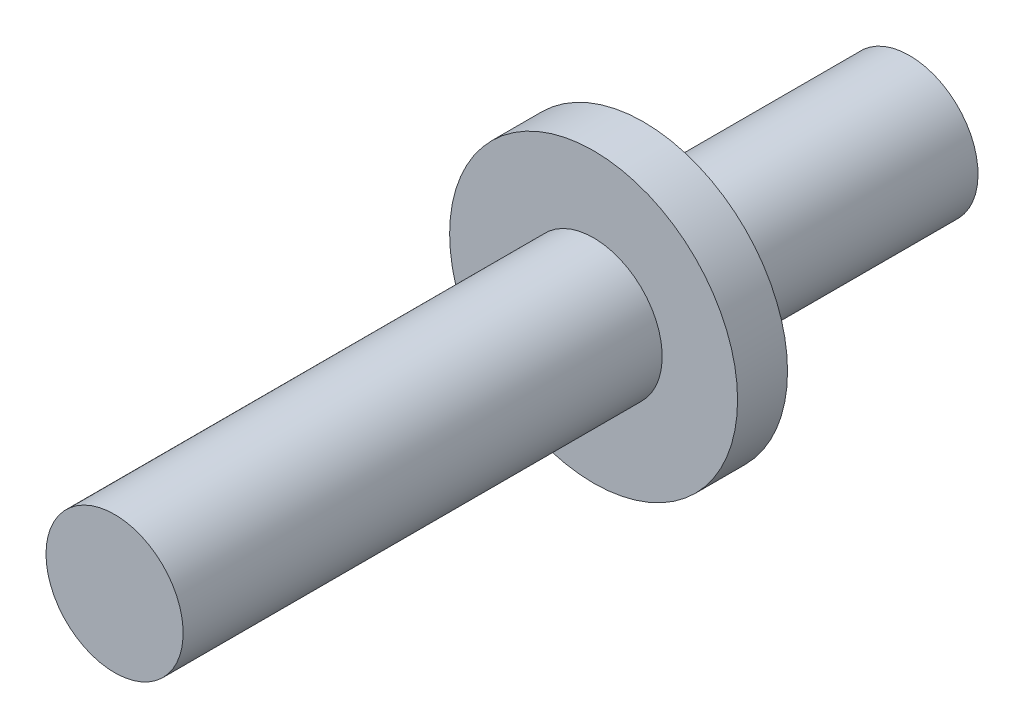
ISO-10303-21;
HEADER;
FILE_DESCRIPTION(('STEP AP214'),'2;1');
FILE_NAME('part.step','',(''),(''),'','','');
FILE_SCHEMA(('AUTOMOTIVE_DESIGN { 1 0 10303 214 1 1 1 1 }'));
ENDSEC;
DATA;
#1=APPLICATION_CONTEXT('core data for automotive mechanical design processes');
#2=APPLICATION_PROTOCOL_DEFINITION('international standard','automotive_design',2000,#1);
#3=PRODUCT_CONTEXT('',#1,'mechanical');
#4=PRODUCT('Part','Part','',(#3));
#5=PRODUCT_RELATED_PRODUCT_CATEGORY('part','',(#4));
#6=PRODUCT_DEFINITION_FORMATION('','',#4);
#7=PRODUCT_DEFINITION_CONTEXT('part definition',#1,'design');
#8=PRODUCT_DEFINITION('design','',#6,#7);
#9=PRODUCT_DEFINITION_SHAPE('','',#8);
#10=(LENGTH_UNIT() NAMED_UNIT(*) SI_UNIT(.MILLI.,.METRE.));
#11=(NAMED_UNIT(*) PLANE_ANGLE_UNIT() SI_UNIT($,.RADIAN.));
#12=(NAMED_UNIT(*) SI_UNIT($,.STERADIAN.) SOLID_ANGLE_UNIT());
#13=UNCERTAINTY_MEASURE_WITH_UNIT(LENGTH_MEASURE(1.E-05),#10,'distance_accuracy_value','');
#14=(GEOMETRIC_REPRESENTATION_CONTEXT(3) GLOBAL_UNCERTAINTY_ASSIGNED_CONTEXT((#13)) GLOBAL_UNIT_ASSIGNED_CONTEXT((#10,
#11,#12)) REPRESENTATION_CONTEXT('',''));
#15=CARTESIAN_POINT('',(0.,0.,0.));
#16=DIRECTION('',(0.,0.,1.));
#17=DIRECTION('',(1.,0.,0.));
#18=AXIS2_PLACEMENT_3D('',#15,#16,#17);
#19=CARTESIAN_POINT('',(0.,0.,-3.46937277));
#20=DIRECTION('',(0.,0.,-1.));
#21=DIRECTION('',(-1.,0.,0.));
#22=AXIS2_PLACEMENT_3D('',#19,#20,#21);
#23=PLANE('',#22);
#24=CARTESIAN_POINT('',(0.,0.,-3.46937277));
#25=DIRECTION('',(0.,0.,-1.));
#26=DIRECTION('',(-1.,0.,0.));
#27=AXIS2_PLACEMENT_3D('',#24,#25,#26);
#28=CIRCLE('',#27,10.);
#29=CARTESIAN_POINT('',(-10.,0.,-3.46937277));
#30=VERTEX_POINT('',#29);
#31=EDGE_CURVE('E41',#30,#30,#28,.T.);
#32=ORIENTED_EDGE('',*,*,#31,.T.);
#33=EDGE_LOOP('',(#32));
#34=FACE_BOUND('',#33,.T.);
#35=CARTESIAN_POINT('',(0.,0.,-3.46937277));
#36=DIRECTION('',(0.,0.,-1.));
#37=DIRECTION('',(0.,1.,0.));
#38=AXIS2_PLACEMENT_3D('',#35,#36,#37);
#39=CIRCLE('',#38,4.7625);
#40=CARTESIAN_POINT('',(0.,4.7625,-3.46937277));
#41=VERTEX_POINT('',#40);
#42=EDGE_CURVE('E49',#41,#41,#39,.T.);
#43=ORIENTED_EDGE('',*,*,#42,.F.);
#44=EDGE_LOOP('',(#43));
#45=FACE_BOUND('',#44,.T.);
#46=ADVANCED_FACE('F30',(#34,#45),#23,.T.);
#47=CARTESIAN_POINT('',(0.,0.,33.2730948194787));
#48=DIRECTION('',(0.,0.,-1.));
#49=DIRECTION('',(-1.,0.,0.));
#50=AXIS2_PLACEMENT_3D('',#47,#48,#49);
#51=CYLINDRICAL_SURFACE('',#50,4.76250000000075);
#52=CARTESIAN_POINT('',(0.,0.,33.2730948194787));
#53=DIRECTION('',(0.,0.,-1.));
#54=DIRECTION('',(-1.,0.,0.));
#55=AXIS2_PLACEMENT_3D('',#52,#53,#54);
#56=CIRCLE('',#55,4.76250000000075);
#57=CARTESIAN_POINT('',(-4.76250000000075,0.,33.2730948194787));
#58=VERTEX_POINT('',#57);
#59=EDGE_CURVE('E10',#58,#58,#56,.T.);
#60=ORIENTED_EDGE('',*,*,#59,.T.);
#61=EDGE_LOOP('',(#60));
#62=FACE_BOUND('',#61,.T.);
#63=CARTESIAN_POINT('',(0.,0.,0.));
#64=DIRECTION('',(0.,0.,-1.));
#65=DIRECTION('',(-1.,0.,0.));
#66=AXIS2_PLACEMENT_3D('',#63,#64,#65);
#67=CIRCLE('',#66,4.76250000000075);
#68=CARTESIAN_POINT('',(-4.76250000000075,0.,0.));
#69=VERTEX_POINT('',#68);
#70=EDGE_CURVE('E34',#69,#69,#67,.T.);
#71=ORIENTED_EDGE('',*,*,#70,.F.);
#72=EDGE_LOOP('',(#71));
#73=FACE_BOUND('',#72,.T.);
#74=ADVANCED_FACE('F32',(#62,#73),#51,.T.);
#75=CARTESIAN_POINT('',(0.,0.,33.2730948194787));
#76=DIRECTION('',(0.,0.,-1.));
#77=DIRECTION('',(-1.,0.,0.));
#78=AXIS2_PLACEMENT_3D('',#75,#76,#77);
#79=PLANE('',#78);
#80=ORIENTED_EDGE('',*,*,#59,.F.);
#81=EDGE_LOOP('',(#80));
#82=FACE_BOUND('',#81,.T.);
#83=ADVANCED_FACE('F70',(#82),#79,.F.);
#84=CARTESIAN_POINT('',(0.,0.,-3.46937277));
#85=DIRECTION('',(0.,0.,1.));
#86=DIRECTION('',(1.,0.,0.));
#87=AXIS2_PLACEMENT_3D('',#84,#85,#86);
#88=CYLINDRICAL_SURFACE('',#87,10.);
#89=ORIENTED_EDGE('',*,*,#31,.F.);
#90=EDGE_LOOP('',(#89));
#91=FACE_BOUND('',#90,.T.);
#92=CARTESIAN_POINT('',(0.,0.,0.));
#93=DIRECTION('',(0.,0.,-1.));
#94=DIRECTION('',(-1.,0.,0.));
#95=AXIS2_PLACEMENT_3D('',#92,#93,#94);
#96=CIRCLE('',#95,10.);
#97=CARTESIAN_POINT('',(-10.,0.,0.));
#98=VERTEX_POINT('',#97);
#99=EDGE_CURVE('E43',#98,#98,#96,.T.);
#100=ORIENTED_EDGE('',*,*,#99,.T.);
#101=EDGE_LOOP('',(#100));
#102=FACE_BOUND('',#101,.T.);
#103=ADVANCED_FACE('F75',(#91,#102),#88,.T.);
#104=CARTESIAN_POINT('',(0.,0.,0.));
#105=DIRECTION('',(0.,0.,-1.));
#106=DIRECTION('',(-1.,0.,0.));
#107=AXIS2_PLACEMENT_3D('',#104,#105,#106);
#108=PLANE('',#107);
#109=ORIENTED_EDGE('',*,*,#70,.T.);
#110=EDGE_LOOP('',(#109));
#111=FACE_BOUND('',#110,.T.);
#112=ORIENTED_EDGE('',*,*,#99,.F.);
#113=EDGE_LOOP('',(#112));
#114=FACE_BOUND('',#113,.T.);
#115=ADVANCED_FACE('F60',(#111,#114),#108,.F.);
#116=CARTESIAN_POINT('',(0.,0.,-21.93874554));
#117=DIRECTION('',(0.,0.,1.));
#118=DIRECTION('',(0.,-1.,0.));
#119=AXIS2_PLACEMENT_3D('',#116,#117,#118);
#120=CYLINDRICAL_SURFACE('',#119,4.7625);
#121=CARTESIAN_POINT('',(0.,0.,-21.93874554));
#122=DIRECTION('',(0.,0.,-1.));
#123=DIRECTION('',(0.,1.,0.));
#124=AXIS2_PLACEMENT_3D('',#121,#122,#123);
#125=CIRCLE('',#124,4.7625);
#126=CARTESIAN_POINT('',(0.,4.7625,-21.93874554));
#127=VERTEX_POINT('',#126);
#128=EDGE_CURVE('E46',#127,#127,#125,.T.);
#129=ORIENTED_EDGE('',*,*,#128,.F.);
#130=EDGE_LOOP('',(#129));
#131=FACE_BOUND('',#130,.T.);
#132=ORIENTED_EDGE('',*,*,#42,.T.);
#133=EDGE_LOOP('',(#132));
#134=FACE_BOUND('',#133,.T.);
#135=ADVANCED_FACE('F57',(#131,#134),#120,.T.);
#136=CARTESIAN_POINT('',(0.,0.,-21.93874554));
#137=DIRECTION('',(0.,0.,-1.));
#138=DIRECTION('',(0.,1.,0.));
#139=AXIS2_PLACEMENT_3D('',#136,#137,#138);
#140=PLANE('',#139);
#141=ORIENTED_EDGE('',*,*,#128,.T.);
#142=EDGE_LOOP('',(#141));
#143=FACE_BOUND('',#142,.T.);
#144=ADVANCED_FACE('F55',(#143),#140,.T.);
#145=CLOSED_SHELL('',(#46,#74,#83,#103,#115,#135,#144));
#146=MANIFOLD_SOLID_BREP('B2',#145);
#147=ADVANCED_BREP_SHAPE_REPRESENTATION('',(#18,#146),#14);
#148=SHAPE_DEFINITION_REPRESENTATION(#9,#147);
ENDSEC;
END-ISO-10303-21;
